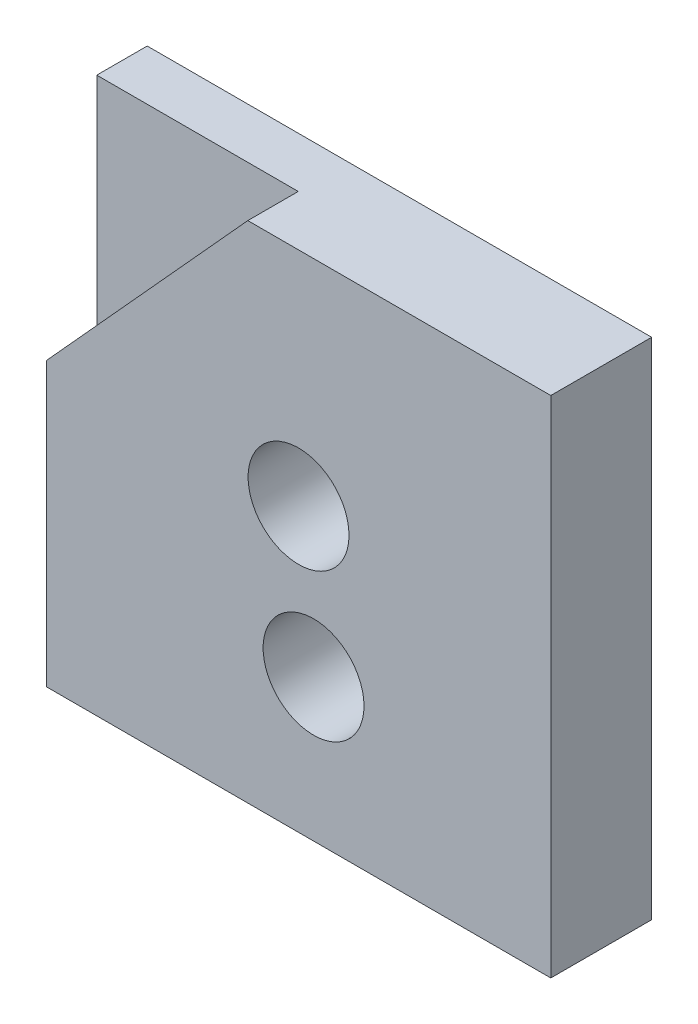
ISO-10303-21;
HEADER;
FILE_DESCRIPTION(('STEP AP214'),'2;1');
FILE_NAME('part.step','',(''),(''),'','','');
FILE_SCHEMA(('AUTOMOTIVE_DESIGN { 1 0 10303 214 1 1 1 1 }'));
ENDSEC;
DATA;
#1=APPLICATION_CONTEXT('core data for automotive mechanical design processes');
#2=APPLICATION_PROTOCOL_DEFINITION('international standard','automotive_design',2000,#1);
#3=PRODUCT_CONTEXT('',#1,'mechanical');
#4=PRODUCT('Part','Part','',(#3));
#5=PRODUCT_RELATED_PRODUCT_CATEGORY('part','',(#4));
#6=PRODUCT_DEFINITION_FORMATION('','',#4);
#7=PRODUCT_DEFINITION_CONTEXT('part definition',#1,'design');
#8=PRODUCT_DEFINITION('design','',#6,#7);
#9=PRODUCT_DEFINITION_SHAPE('','',#8);
#10=(LENGTH_UNIT() NAMED_UNIT(*) SI_UNIT(.MILLI.,.METRE.));
#11=(NAMED_UNIT(*) PLANE_ANGLE_UNIT() SI_UNIT($,.RADIAN.));
#12=(NAMED_UNIT(*) SI_UNIT($,.STERADIAN.) SOLID_ANGLE_UNIT());
#13=UNCERTAINTY_MEASURE_WITH_UNIT(LENGTH_MEASURE(1.E-05),#10,'distance_accuracy_value','');
#14=(GEOMETRIC_REPRESENTATION_CONTEXT(3) GLOBAL_UNCERTAINTY_ASSIGNED_CONTEXT((#13)) GLOBAL_UNIT_ASSIGNED_CONTEXT((#10,
#11,#12)) REPRESENTATION_CONTEXT('',''));
#15=CARTESIAN_POINT('',(0.,0.,0.));
#16=DIRECTION('',(0.,0.,1.));
#17=DIRECTION('',(1.,0.,0.));
#18=AXIS2_PLACEMENT_3D('',#15,#16,#17);
#19=CARTESIAN_POINT('',(0.,0.,10.));
#20=DIRECTION('',(0.,0.,1.));
#21=DIRECTION('',(1.,0.,0.));
#22=AXIS2_PLACEMENT_3D('',#19,#20,#21);
#23=PLANE('',#22);
#24=CARTESIAN_POINT('',(-25.,28.,10.));
#25=DIRECTION('',(0.,0.,1.));
#26=DIRECTION('',(1.,0.,0.));
#27=AXIS2_PLACEMENT_3D('',#24,#25,#26);
#28=CIRCLE('',#27,5.);
#29=CARTESIAN_POINT('',(-20.,28.,10.));
#30=VERTEX_POINT('',#29);
#31=EDGE_CURVE('E185',#30,#30,#28,.T.);
#32=ORIENTED_EDGE('',*,*,#31,.F.);
#33=EDGE_LOOP('',(#32));
#34=FACE_BOUND('',#33,.T.);
#35=DIRECTION('',(0.672119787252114,0.740442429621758,0.));
#36=VECTOR('',#35,1.);
#37=CARTESIAN_POINT('',(-50.,28.,10.));
#38=LINE('',#37,#36);
#39=CARTESIAN_POINT('',(-50.,28.,10.));
#40=VERTEX_POINT('',#39);
#41=CARTESIAN_POINT('',(-30.03,50.,10.));
#42=VERTEX_POINT('',#41);
#43=EDGE_CURVE('E107',#40,#42,#38,.T.);
#44=ORIENTED_EDGE('',*,*,#43,.F.);
#45=DIRECTION('',(0.,-1.,0.));
#46=VECTOR('',#45,1.);
#47=CARTESIAN_POINT('',(-50.,0.,10.));
#48=LINE('',#47,#46);
#49=CARTESIAN_POINT('',(-50.,0.,10.));
#50=VERTEX_POINT('',#49);
#51=EDGE_CURVE('E112',#40,#50,#48,.T.);
#52=ORIENTED_EDGE('',*,*,#51,.T.);
#53=DIRECTION('',(1.,0.,0.));
#54=VECTOR('',#53,1.);
#55=CARTESIAN_POINT('',(0.,0.,10.));
#56=LINE('',#55,#54);
#57=CARTESIAN_POINT('',(0.,0.,10.));
#58=VERTEX_POINT('',#57);
#59=EDGE_CURVE('E57',#50,#58,#56,.T.);
#60=ORIENTED_EDGE('',*,*,#59,.T.);
#61=DIRECTION('',(0.,1.,0.));
#62=VECTOR('',#61,1.);
#63=CARTESIAN_POINT('',(0.,0.,10.));
#64=LINE('',#63,#62);
#65=CARTESIAN_POINT('',(0.,50.,10.));
#66=VERTEX_POINT('',#65);
#67=EDGE_CURVE('E125',#58,#66,#64,.T.);
#68=ORIENTED_EDGE('',*,*,#67,.T.);
#69=DIRECTION('',(-1.,0.,0.));
#70=VECTOR('',#69,1.);
#71=CARTESIAN_POINT('',(0.,50.,10.));
#72=LINE('',#71,#70);
#73=EDGE_CURVE('E83',#66,#42,#72,.T.);
#74=ORIENTED_EDGE('',*,*,#73,.T.);
#75=EDGE_LOOP('',(#44,#52,#60,#68,#74));
#76=FACE_BOUND('',#75,.T.);
#77=CARTESIAN_POINT('',(-23.5115722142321,14.0841468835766,10.));
#78=DIRECTION('',(0.,0.,1.));
#79=DIRECTION('',(1.,0.,0.));
#80=AXIS2_PLACEMENT_3D('',#77,#78,#79);
#81=CIRCLE('',#80,5.);
#82=CARTESIAN_POINT('',(-18.5115722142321,14.0841468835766,10.));
#83=VERTEX_POINT('',#82);
#84=EDGE_CURVE('E119',#83,#83,#81,.T.);
#85=ORIENTED_EDGE('',*,*,#84,.F.);
#86=EDGE_LOOP('',(#85));
#87=FACE_BOUND('',#86,.T.);
#88=ADVANCED_FACE('F33',(#34,#76,#87),#23,.T.);
#89=CARTESIAN_POINT('',(0.,0.,0.));
#90=DIRECTION('',(0.,0.,1.));
#91=DIRECTION('',(1.,0.,0.));
#92=AXIS2_PLACEMENT_3D('',#89,#90,#91);
#93=PLANE('',#92);
#94=CARTESIAN_POINT('',(-25.,28.,0.));
#95=DIRECTION('',(0.,0.,1.));
#96=DIRECTION('',(1.,0.,0.));
#97=AXIS2_PLACEMENT_3D('',#94,#95,#96);
#98=CIRCLE('',#97,5.);
#99=CARTESIAN_POINT('',(-20.,28.,0.));
#100=VERTEX_POINT('',#99);
#101=EDGE_CURVE('E183',#100,#100,#98,.T.);
#102=ORIENTED_EDGE('',*,*,#101,.T.);
#103=EDGE_LOOP('',(#102));
#104=FACE_BOUND('',#103,.T.);
#105=DIRECTION('',(0.,1.,0.));
#106=VECTOR('',#105,1.);
#107=CARTESIAN_POINT('',(0.,0.,0.));
#108=LINE('',#107,#106);
#109=CARTESIAN_POINT('',(0.,0.,0.));
#110=VERTEX_POINT('',#109);
#111=CARTESIAN_POINT('',(0.,50.,0.));
#112=VERTEX_POINT('',#111);
#113=EDGE_CURVE('E122',#110,#112,#108,.T.);
#114=ORIENTED_EDGE('',*,*,#113,.F.);
#115=DIRECTION('',(1.,0.,0.));
#116=VECTOR('',#115,1.);
#117=CARTESIAN_POINT('',(0.,0.,0.));
#118=LINE('',#117,#116);
#119=CARTESIAN_POINT('',(-50.,0.,0.));
#120=VERTEX_POINT('',#119);
#121=EDGE_CURVE('E77',#120,#110,#118,.T.);
#122=ORIENTED_EDGE('',*,*,#121,.F.);
#123=DIRECTION('',(0.,-1.,0.));
#124=VECTOR('',#123,1.);
#125=CARTESIAN_POINT('',(-50.,0.,0.));
#126=LINE('',#125,#124);
#127=CARTESIAN_POINT('',(-50.,50.,0.));
#128=VERTEX_POINT('',#127);
#129=EDGE_CURVE('E136',#128,#120,#126,.T.);
#130=ORIENTED_EDGE('',*,*,#129,.F.);
#131=DIRECTION('',(-1.,0.,0.));
#132=VECTOR('',#131,1.);
#133=CARTESIAN_POINT('',(0.,50.,0.));
#134=LINE('',#133,#132);
#135=EDGE_CURVE('E133',#112,#128,#134,.T.);
#136=ORIENTED_EDGE('',*,*,#135,.F.);
#137=EDGE_LOOP('',(#114,#122,#130,#136));
#138=FACE_BOUND('',#137,.T.);
#139=CARTESIAN_POINT('',(-23.5115722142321,14.0841468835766,0.));
#140=DIRECTION('',(0.,0.,1.));
#141=DIRECTION('',(1.,0.,0.));
#142=AXIS2_PLACEMENT_3D('',#139,#140,#141);
#143=CIRCLE('',#142,5.);
#144=CARTESIAN_POINT('',(-18.5115722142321,14.0841468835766,0.));
#145=VERTEX_POINT('',#144);
#146=EDGE_CURVE('E114',#145,#145,#143,.T.);
#147=ORIENTED_EDGE('',*,*,#146,.T.);
#148=EDGE_LOOP('',(#147));
#149=FACE_BOUND('',#148,.T.);
#150=ADVANCED_FACE('F146',(#104,#138,#149),#93,.F.);
#151=CARTESIAN_POINT('',(0.,0.,10.));
#152=DIRECTION('',(-1.,0.,0.));
#153=DIRECTION('',(0.,0.,1.));
#154=AXIS2_PLACEMENT_3D('',#151,#152,#153);
#155=PLANE('',#154);
#156=ORIENTED_EDGE('',*,*,#113,.T.);
#157=DIRECTION('',(0.,0.,-1.));
#158=VECTOR('',#157,1.);
#159=CARTESIAN_POINT('',(0.,50.,10.));
#160=LINE('',#159,#158);
#161=EDGE_CURVE('E11',#66,#112,#160,.T.);
#162=ORIENTED_EDGE('',*,*,#161,.F.);
#163=ORIENTED_EDGE('',*,*,#67,.F.);
#164=DIRECTION('',(0.,0.,-1.));
#165=VECTOR('',#164,1.);
#166=CARTESIAN_POINT('',(0.,0.,10.));
#167=LINE('',#166,#165);
#168=EDGE_CURVE('E130',#58,#110,#167,.T.);
#169=ORIENTED_EDGE('',*,*,#168,.T.);
#170=EDGE_LOOP('',(#156,#162,#163,#169));
#171=FACE_BOUND('',#170,.T.);
#172=ADVANCED_FACE('F35',(#171),#155,.F.);
#173=CARTESIAN_POINT('',(0.,50.,10.));
#174=DIRECTION('',(0.,-1.,0.));
#175=DIRECTION('',(1.,0.,0.));
#176=AXIS2_PLACEMENT_3D('',#173,#174,#175);
#177=PLANE('',#176);
#178=DIRECTION('',(-1.,0.,0.));
#179=VECTOR('',#178,1.);
#180=CARTESIAN_POINT('',(-30.03,50.,5.));
#181=LINE('',#180,#179);
#182=CARTESIAN_POINT('',(-30.03,50.,5.));
#183=VERTEX_POINT('',#182);
#184=CARTESIAN_POINT('',(-50.,50.,5.));
#185=VERTEX_POINT('',#184);
#186=EDGE_CURVE('E48',#183,#185,#181,.T.);
#187=ORIENTED_EDGE('',*,*,#186,.F.);
#188=DIRECTION('',(0.,0.,1.));
#189=VECTOR('',#188,1.);
#190=CARTESIAN_POINT('',(-30.03,50.,5.));
#191=LINE('',#190,#189);
#192=EDGE_CURVE('E101',#183,#42,#191,.T.);
#193=ORIENTED_EDGE('',*,*,#192,.T.);
#194=ORIENTED_EDGE('',*,*,#73,.F.);
#195=ORIENTED_EDGE('',*,*,#161,.T.);
#196=ORIENTED_EDGE('',*,*,#135,.T.);
#197=DIRECTION('',(0.,0.,-1.));
#198=VECTOR('',#197,1.);
#199=CARTESIAN_POINT('',(-50.,50.,10.));
#200=LINE('',#199,#198);
#201=EDGE_CURVE('E41',#185,#128,#200,.T.);
#202=ORIENTED_EDGE('',*,*,#201,.F.);
#203=EDGE_LOOP('',(#187,#193,#194,#195,#196,#202));
#204=FACE_BOUND('',#203,.T.);
#205=ADVANCED_FACE('F142',(#204),#177,.F.);
#206=CARTESIAN_POINT('',(-50.,0.,10.));
#207=DIRECTION('',(1.,0.,0.));
#208=DIRECTION('',(0.,0.,-1.));
#209=AXIS2_PLACEMENT_3D('',#206,#207,#208);
#210=PLANE('',#209);
#211=ORIENTED_EDGE('',*,*,#51,.F.);
#212=DIRECTION('',(0.,0.,1.));
#213=VECTOR('',#212,1.);
#214=CARTESIAN_POINT('',(-50.,28.,5.));
#215=LINE('',#214,#213);
#216=CARTESIAN_POINT('',(-50.,28.,5.));
#217=VERTEX_POINT('',#216);
#218=EDGE_CURVE('E99',#217,#40,#215,.T.);
#219=ORIENTED_EDGE('',*,*,#218,.F.);
#220=DIRECTION('',(0.,-1.,0.));
#221=VECTOR('',#220,1.);
#222=CARTESIAN_POINT('',(-50.,50.,5.));
#223=LINE('',#222,#221);
#224=EDGE_CURVE('E102',#185,#217,#223,.T.);
#225=ORIENTED_EDGE('',*,*,#224,.F.);
#226=ORIENTED_EDGE('',*,*,#201,.T.);
#227=ORIENTED_EDGE('',*,*,#129,.T.);
#228=DIRECTION('',(0.,0.,-1.));
#229=VECTOR('',#228,1.);
#230=CARTESIAN_POINT('',(-50.,0.,10.));
#231=LINE('',#230,#229);
#232=EDGE_CURVE('E140',#50,#120,#231,.T.);
#233=ORIENTED_EDGE('',*,*,#232,.F.);
#234=EDGE_LOOP('',(#211,#219,#225,#226,#227,#233));
#235=FACE_BOUND('',#234,.T.);
#236=ADVANCED_FACE('F110',(#235),#210,.F.);
#237=CARTESIAN_POINT('',(0.,0.,10.));
#238=DIRECTION('',(0.,1.,0.));
#239=DIRECTION('',(-1.,0.,0.));
#240=AXIS2_PLACEMENT_3D('',#237,#238,#239);
#241=PLANE('',#240);
#242=ORIENTED_EDGE('',*,*,#121,.T.);
#243=ORIENTED_EDGE('',*,*,#168,.F.);
#244=ORIENTED_EDGE('',*,*,#59,.F.);
#245=ORIENTED_EDGE('',*,*,#232,.T.);
#246=EDGE_LOOP('',(#242,#243,#244,#245));
#247=FACE_BOUND('',#246,.T.);
#248=ADVANCED_FACE('F150',(#247),#241,.F.);
#249=CARTESIAN_POINT('',(-23.5115722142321,14.0841468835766,10.));
#250=DIRECTION('',(0.,0.,-1.));
#251=DIRECTION('',(-1.,0.,0.));
#252=AXIS2_PLACEMENT_3D('',#249,#250,#251);
#253=CYLINDRICAL_SURFACE('',#252,5.);
#254=ORIENTED_EDGE('',*,*,#84,.T.);
#255=EDGE_LOOP('',(#254));
#256=FACE_BOUND('',#255,.T.);
#257=ORIENTED_EDGE('',*,*,#146,.F.);
#258=EDGE_LOOP('',(#257));
#259=FACE_BOUND('',#258,.T.);
#260=ADVANCED_FACE('F152',(#256,#259),#253,.F.);
#261=CARTESIAN_POINT('',(-50.,28.,5.));
#262=DIRECTION('',(0.740442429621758,-0.672119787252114,0.));
#263=DIRECTION('',(0.672119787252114,0.740442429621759,0.));
#264=AXIS2_PLACEMENT_3D('',#261,#262,#263);
#265=PLANE('',#264);
#266=ORIENTED_EDGE('',*,*,#43,.T.);
#267=ORIENTED_EDGE('',*,*,#192,.F.);
#268=DIRECTION('',(0.672119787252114,0.740442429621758,0.));
#269=VECTOR('',#268,1.);
#270=CARTESIAN_POINT('',(-50.,28.,5.));
#271=LINE('',#270,#269);
#272=EDGE_CURVE('E96',#217,#183,#271,.T.);
#273=ORIENTED_EDGE('',*,*,#272,.F.);
#274=ORIENTED_EDGE('',*,*,#218,.T.);
#275=EDGE_LOOP('',(#266,#267,#273,#274));
#276=FACE_BOUND('',#275,.T.);
#277=ADVANCED_FACE('F97',(#276),#265,.F.);
#278=CARTESIAN_POINT('',(0.,0.,5.));
#279=DIRECTION('',(0.,0.,-1.));
#280=DIRECTION('',(-1.,0.,0.));
#281=AXIS2_PLACEMENT_3D('',#278,#279,#280);
#282=PLANE('',#281);
#283=ORIENTED_EDGE('',*,*,#224,.T.);
#284=ORIENTED_EDGE('',*,*,#272,.T.);
#285=ORIENTED_EDGE('',*,*,#186,.T.);
#286=EDGE_LOOP('',(#283,#284,#285));
#287=FACE_BOUND('',#286,.T.);
#288=ADVANCED_FACE('F104',(#287),#282,.F.);
#289=CARTESIAN_POINT('',(-25.,28.,0.));
#290=DIRECTION('',(0.,0.,1.));
#291=DIRECTION('',(1.,0.,0.));
#292=AXIS2_PLACEMENT_3D('',#289,#290,#291);
#293=CYLINDRICAL_SURFACE('',#292,5.);
#294=ORIENTED_EDGE('',*,*,#101,.F.);
#295=EDGE_LOOP('',(#294));
#296=FACE_BOUND('',#295,.T.);
#297=ORIENTED_EDGE('',*,*,#31,.T.);
#298=EDGE_LOOP('',(#297));
#299=FACE_BOUND('',#298,.T.);
#300=ADVANCED_FACE('F175',(#296,#299),#293,.F.);
#301=CLOSED_SHELL('',(#88,#150,#172,#205,#236,#248,#260,#277,#288,#300));
#302=MANIFOLD_SOLID_BREP('B2',#301);
#303=ADVANCED_BREP_SHAPE_REPRESENTATION('',(#18,#302),#14);
#304=SHAPE_DEFINITION_REPRESENTATION(#9,#303);
ENDSEC;
END-ISO-10303-21;
